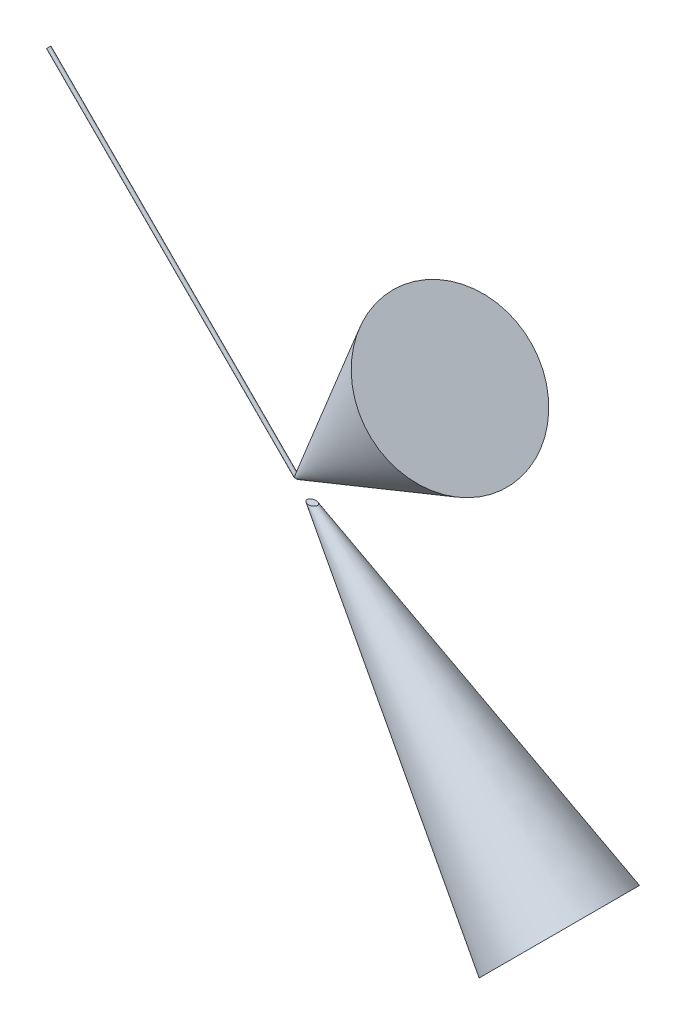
from build123d import *

# Parameters (mm, degrees)
ESQUISSE4_W             = 15.976701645
ESQUISSE4_H             = 2
ENL_V_MAT_EXTRU_1_DEPTH = 5
ESQUISSE5_R             = 0.25
BOSS_EXTRU_1_DEPTH      = 30
BOSS_EXTRU_1_DRAFT      = -20
ESQUISSE6_W             = 15.976701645
ESQUISSE6_H             = 2
ENL_V_MAT_EXTRU_2_DEPTH = 15


with BuildPart() as part:
    # Esquisse1 → R_volution1 (revolve)
    with BuildSketch(Plane(origin=(0, 0, 0), x_dir=(0.7071067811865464, -0.7071067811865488, 0), z_dir=(0.7071067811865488, 0.7071067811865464, 0)), mode=Mode.PRIVATE) as r_volution1_sk:
        Polygon((-50, 0), (-50, 0.25), (0, 0.25), (50, 9.066349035), (50, 0), align=None)
    revolve(r_volution1_sk.sketch.rotate(Axis((-55.558556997, 55.558556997, 0), (0.7071067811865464, -0.7071067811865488, 0)), 270), axis=Axis((-55.558556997, 55.558556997, 0), (0.7071067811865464, -0.7071067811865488, 0)))

    # Esquisse4 → Enl_v. mat.-Extru.1 (cut, symmetric)
    with BuildSketch(Plane.XY):
        with Locations((2.091772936, 0)):
            Rectangle(ESQUISSE4_W, ESQUISSE4_H)
    extrude(amount=ENL_V_MAT_EXTRU_1_DEPTH, both=True, mode=Mode.SUBTRACT)


with BuildPart() as enl_v_mat_extru_1_piece_1:
    # of the separate pieces the step leaves, piece 1, a body of its own (enl_v_mat_extru_1_pieces)
    add(part.part.solids().sort_by_distance((0.399650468, -1, 0))[0])


with BuildPart() as enl_v_mat_extru_1_piece_2:
    # of the separate pieces the step leaves, piece 2, a body of its own (enl_v_mat_extru_1_pieces)
    add(part.part.solids().sort_by_distance((-35.532115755, 35.178562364, 0))[0])


with BuildPart() as boss_extru_1_tool:
    # Esquisse5 → Boss.-Extru.1 (with draft: the straight prism first)
    with BuildSketch(Plane(origin=(0, 0, 0), x_dir=(0.7071067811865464, -0.7071067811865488, 0), z_dir=(0.7071067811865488, 0.7071067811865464, 0))):
        with Locations((-1.414213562, 0)):
            Circle(ESQUISSE5_R)
    extrude(amount=BOSS_EXTRU_1_DEPTH)
    # Boss.-Extru.1: the draft: its side faces are tilted about the plane it starts from
    boss_extru_1_sides = [boss_extru_1_tool.faces().sort_by_distance(p)[0] for p in [
        (9.429825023, 11.783378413, 0),
    ]]
    draft(boss_extru_1_sides, Plane(origin=(0, 0, 0), x_dir=(0.7071067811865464, -0.7071067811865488, 0), z_dir=(0.7071067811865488, 0.7071067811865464, 0)), BOSS_EXTRU_1_DRAFT)


with BuildPart() as enl_v_mat_extru_1_piece_2_1:
    add(enl_v_mat_extru_1_piece_2.part)

    # Boss.-Extru.1: add boss_extru_1_tool
    add(boss_extru_1_tool.part)

    # Esquisse6 → Enl_v. mat.-Extru.2 (cut, symmetric)
    with BuildSketch(Plane.XY):
        with Locations((2.091772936, 0)):
            Rectangle(ESQUISSE6_W, ESQUISSE6_H)
    extrude(amount=ENL_V_MAT_EXTRU_2_DEPTH, both=True, mode=Mode.SUBTRACT)


solid = Compound([enl_v_mat_extru_1_piece_1.part, enl_v_mat_extru_1_piece_2_1.part])
